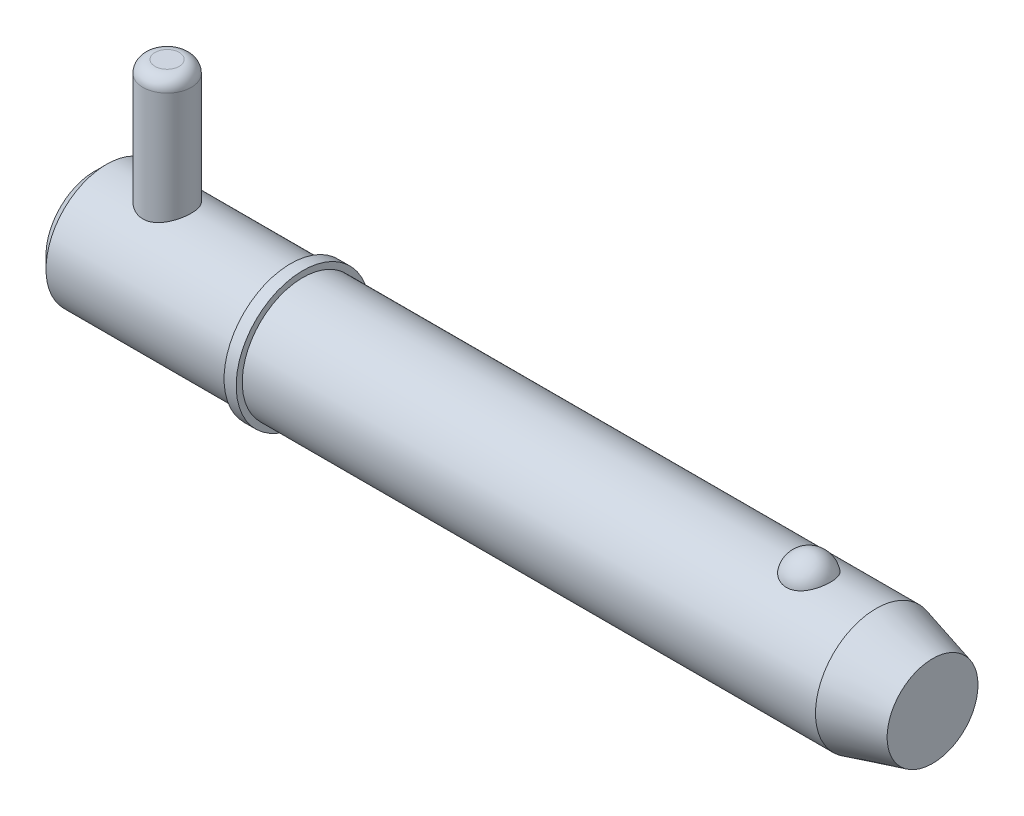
ISO-10303-21;
HEADER;
FILE_DESCRIPTION(('STEP AP214'),'2;1');
FILE_NAME('part.step','',(''),(''),'','','');
FILE_SCHEMA(('AUTOMOTIVE_DESIGN { 1 0 10303 214 1 1 1 1 }'));
ENDSEC;
DATA;
#1=APPLICATION_CONTEXT('core data for automotive mechanical design processes');
#2=APPLICATION_PROTOCOL_DEFINITION('international standard','automotive_design',2000,#1);
#3=PRODUCT_CONTEXT('',#1,'mechanical');
#4=PRODUCT('Part','Part','',(#3));
#5=PRODUCT_RELATED_PRODUCT_CATEGORY('part','',(#4));
#6=PRODUCT_DEFINITION_FORMATION('','',#4);
#7=PRODUCT_DEFINITION_CONTEXT('part definition',#1,'design');
#8=PRODUCT_DEFINITION('design','',#6,#7);
#9=PRODUCT_DEFINITION_SHAPE('','',#8);
#10=(LENGTH_UNIT() NAMED_UNIT(*) SI_UNIT(.MILLI.,.METRE.));
#11=(NAMED_UNIT(*) PLANE_ANGLE_UNIT() SI_UNIT($,.RADIAN.));
#12=(NAMED_UNIT(*) SI_UNIT($,.STERADIAN.) SOLID_ANGLE_UNIT());
#13=UNCERTAINTY_MEASURE_WITH_UNIT(LENGTH_MEASURE(1.E-05),#10,'distance_accuracy_value','');
#14=(GEOMETRIC_REPRESENTATION_CONTEXT(3) GLOBAL_UNCERTAINTY_ASSIGNED_CONTEXT((#13)) GLOBAL_UNIT_ASSIGNED_CONTEXT((#10,
#11,#12)) REPRESENTATION_CONTEXT('',''));
#15=CARTESIAN_POINT('',(0.,0.,0.));
#16=DIRECTION('',(0.,0.,1.));
#17=DIRECTION('',(1.,0.,0.));
#18=AXIS2_PLACEMENT_3D('',#15,#16,#17);
#19=CARTESIAN_POINT('',(9.525,23.81,0.));
#20=DIRECTION('',(0.,-1.,0.));
#21=DIRECTION('',(0.,0.,-1.));
#22=AXIS2_PLACEMENT_3D('',#19,#20,#21);
#23=CYLINDRICAL_SURFACE('',#22,3.175);
#24=CARTESIAN_POINT('',(9.525,-6.3525,0.));
#25=DIRECTION('',(0.,1.,0.));
#26=DIRECTION('',(0.,0.,1.));
#27=AXIS2_PLACEMENT_3D('',#24,#25,#26);
#28=CIRCLE('',#27,3.175);
#29=CARTESIAN_POINT('',(9.525,-6.3525,3.175));
#30=VERTEX_POINT('',#29);
#31=EDGE_CURVE('P0_E25',#30,#30,#28,.T.);
#32=ORIENTED_EDGE('',*,*,#31,.T.);
#33=EDGE_LOOP('',(#32));
#34=FACE_BOUND('',#33,.T.);
#35=CARTESIAN_POINT('',(9.525,22.2225,0.));
#36=DIRECTION('',(0.,1.,0.));
#37=DIRECTION('',(0.,0.,1.));
#38=AXIS2_PLACEMENT_3D('',#35,#36,#37);
#39=CIRCLE('',#38,3.175);
#40=CARTESIAN_POINT('',(9.525,22.2225,3.175));
#41=VERTEX_POINT('',#40);
#42=EDGE_CURVE('P0_E29',#41,#41,#39,.F.);
#43=ORIENTED_EDGE('',*,*,#42,.T.);
#44=EDGE_LOOP('',(#43));
#45=FACE_BOUND('',#44,.T.);
#46=ADVANCED_FACE('P0_F14',(#34,#45),#23,.T.);
#47=CARTESIAN_POINT('',(9.525,23.81,0.));
#48=DIRECTION('',(0.,1.,0.));
#49=DIRECTION('',(0.,0.,1.));
#50=AXIS2_PLACEMENT_3D('',#47,#48,#49);
#51=PLANE('',#50);
#52=CARTESIAN_POINT('',(9.525,23.81,0.));
#53=DIRECTION('',(0.,1.,0.));
#54=DIRECTION('',(0.,0.,1.));
#55=AXIS2_PLACEMENT_3D('',#52,#53,#54);
#56=CIRCLE('',#55,1.5875);
#57=CARTESIAN_POINT('',(9.525,23.81,1.5875));
#58=VERTEX_POINT('',#57);
#59=EDGE_CURVE('P0_E10',#58,#58,#56,.T.);
#60=ORIENTED_EDGE('',*,*,#59,.T.);
#61=EDGE_LOOP('',(#60));
#62=FACE_BOUND('',#61,.T.);
#63=ADVANCED_FACE('P0_F46',(#62),#51,.T.);
#64=CARTESIAN_POINT('',(9.525,-7.94,0.));
#65=DIRECTION('',(0.,1.,0.));
#66=DIRECTION('',(0.,0.,1.));
#67=AXIS2_PLACEMENT_3D('',#64,#65,#66);
#68=PLANE('',#67);
#69=CARTESIAN_POINT('',(9.525,-7.94,0.));
#70=DIRECTION('',(0.,1.,0.));
#71=DIRECTION('',(0.,0.,1.));
#72=AXIS2_PLACEMENT_3D('',#69,#70,#71);
#73=CIRCLE('',#72,1.5875);
#74=CARTESIAN_POINT('',(9.525,-7.94,1.5875));
#75=VERTEX_POINT('',#74);
#76=EDGE_CURVE('P0_E21',#75,#75,#73,.F.);
#77=ORIENTED_EDGE('',*,*,#76,.T.);
#78=EDGE_LOOP('',(#77));
#79=FACE_BOUND('',#78,.T.);
#80=ADVANCED_FACE('P0_F43',(#79),#68,.F.);
#81=CARTESIAN_POINT('',(9.525,-6.3525,0.));
#82=DIRECTION('',(0.,1.,0.));
#83=DIRECTION('',(0.,0.,1.));
#84=AXIS2_PLACEMENT_3D('',#81,#82,#83);
#85=DEGENERATE_TOROIDAL_SURFACE('',#84,1.5875,1.5875,.T.);
#86=ORIENTED_EDGE('',*,*,#76,.F.);
#87=EDGE_LOOP('',(#86));
#88=FACE_BOUND('',#87,.T.);
#89=ORIENTED_EDGE('',*,*,#31,.F.);
#90=EDGE_LOOP('',(#89));
#91=FACE_BOUND('',#90,.T.);
#92=ADVANCED_FACE('P0_F38',(#88,#91),#85,.T.);
#93=CARTESIAN_POINT('',(9.525,22.2225,0.));
#94=DIRECTION('',(0.,1.,0.));
#95=DIRECTION('',(0.,0.,1.));
#96=AXIS2_PLACEMENT_3D('',#93,#94,#95);
#97=DEGENERATE_TOROIDAL_SURFACE('',#96,1.5875,1.5875,.T.);
#98=ORIENTED_EDGE('',*,*,#42,.F.);
#99=EDGE_LOOP('',(#98));
#100=FACE_BOUND('',#99,.T.);
#101=ORIENTED_EDGE('',*,*,#59,.F.);
#102=EDGE_LOOP('',(#101));
#103=FACE_BOUND('',#102,.T.);
#104=ADVANCED_FACE('P0_F16',(#100,#103),#97,.T.);
#105=CLOSED_SHELL('',(#46,#63,#80,#92,#104));
#106=MANIFOLD_SOLID_BREP('P0_B1',#105);
#107=CARTESIAN_POINT('',(0.,0.,0.));
#108=DIRECTION('',(1.,0.,0.));
#109=DIRECTION('',(0.,0.,-1.));
#110=AXIS2_PLACEMENT_3D('',#107,#108,#109);
#111=CYLINDRICAL_SURFACE('',#110,7.94);
#112=CARTESIAN_POINT('',(102.451879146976,0.,0.));
#113=DIRECTION('',(1.,0.,0.));
#114=DIRECTION('',(0.,0.,-1.));
#115=AXIS2_PLACEMENT_3D('',#112,#113,#114);
#116=CIRCLE('',#115,7.94);
#117=CARTESIAN_POINT('',(102.451879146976,0.,-7.94));
#118=VERTEX_POINT('',#117);
#119=EDGE_CURVE('P1_E81',#118,#118,#116,.T.);
#120=ORIENTED_EDGE('',*,*,#119,.F.);
#121=EDGE_LOOP('',(#120));
#122=FACE_BOUND('',#121,.T.);
#123=CARTESIAN_POINT('',(27.31,0.,0.));
#124=DIRECTION('',(1.,0.,0.));
#125=DIRECTION('',(0.,0.,-1.));
#126=AXIS2_PLACEMENT_3D('',#123,#124,#125);
#127=CIRCLE('',#126,7.94);
#128=CARTESIAN_POINT('',(27.31,0.,-7.94));
#129=VERTEX_POINT('',#128);
#130=EDGE_CURVE('P1_E85',#129,#129,#127,.T.);
#131=ORIENTED_EDGE('',*,*,#130,.T.);
#132=EDGE_LOOP('',(#131));
#133=FACE_BOUND('',#132,.T.);
#134=CARTESIAN_POINT('',(93.6449074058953,7.37767842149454,2.93486986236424));
#135=CARTESIAN_POINT('',(93.4927496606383,7.37767329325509,2.9348750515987));
#136=CARTESIAN_POINT('',(93.3406329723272,7.38258419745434,2.92262454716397));
#137=CARTESIAN_POINT('',(93.0409284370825,7.40163229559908,2.87404196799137));
#138=CARTESIAN_POINT('',(92.8933394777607,7.41576720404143,2.83771585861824));
#139=CARTESIAN_POINT('',(92.6070187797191,7.45161576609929,2.74218769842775));
#140=CARTESIAN_POINT('',(92.4682745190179,7.47331841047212,2.68301886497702));
#141=CARTESIAN_POINT('',(92.2028822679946,7.52194082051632,2.54350967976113));
#142=CARTESIAN_POINT('',(92.0762366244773,7.54886159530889,2.46316523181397));
#143=CARTESIAN_POINT('',(91.8345349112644,7.60594671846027,2.28090375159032));
#144=CARTESIAN_POINT('',(91.7199065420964,7.63618114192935,2.1784421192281));
#145=CARTESIAN_POINT('',(91.5088787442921,7.69614046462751,1.95608495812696));
#146=CARTESIAN_POINT('',(91.4124826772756,7.72586526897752,1.83618622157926));
#147=CARTESIAN_POINT('',(91.2359381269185,7.78314821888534,1.57628086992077));
#148=CARTESIAN_POINT('',(91.1567072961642,7.81055035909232,1.43561546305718));
#149=CARTESIAN_POINT('',(91.0217979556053,7.85879631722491,1.14236334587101));
#150=CARTESIAN_POINT('',(90.9661216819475,7.87963951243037,0.98977550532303));
#151=CARTESIAN_POINT('',(90.8788121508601,7.91289645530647,0.674619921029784));
#152=CARTESIAN_POINT('',(90.8475309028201,7.92518652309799,0.511941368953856));
#153=CARTESIAN_POINT('',(90.8109756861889,7.93958930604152,0.18324773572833));
#154=CARTESIAN_POINT('',(90.8057012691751,7.94170219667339,0.0172327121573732));
#155=CARTESIAN_POINT('',(90.8212311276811,7.93554931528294,-0.312672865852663));
#156=CARTESIAN_POINT('',(90.8419253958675,7.92732732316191,-0.476569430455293));
#157=CARTESIAN_POINT('',(90.9087865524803,7.90141534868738,-0.798305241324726));
#158=CARTESIAN_POINT('',(90.9549539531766,7.88372517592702,-0.95614436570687));
#159=CARTESIAN_POINT('',(91.0718986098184,7.84066230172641,-1.26152073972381));
#160=CARTESIAN_POINT('',(91.1427046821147,7.81528060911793,-1.40904568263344));
#161=CARTESIAN_POINT('',(91.3074789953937,7.7594867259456,-1.68950598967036));
#162=CARTESIAN_POINT('',(91.4014488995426,7.72907417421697,-1.82244030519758));
#163=CARTESIAN_POINT('',(91.6108391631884,7.66640424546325,-2.07032792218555));
#164=CARTESIAN_POINT('',(91.7263152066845,7.63414223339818,-2.1852330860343));
#165=CARTESIAN_POINT('',(91.9759006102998,7.57149681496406,-2.39329737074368));
#166=CARTESIAN_POINT('',(92.1100080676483,7.54111321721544,-2.48645870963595));
#167=CARTESIAN_POINT('',(92.3901113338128,7.48650742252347,-2.64628132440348));
#168=CARTESIAN_POINT('',(92.5357605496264,7.46215900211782,-2.71350554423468));
#169=CARTESIAN_POINT('',(92.8374259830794,7.42171253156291,-2.82226614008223));
#170=CARTESIAN_POINT('',(92.9934383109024,7.40561140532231,-2.86381209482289));
#171=CARTESIAN_POINT('',(93.3029708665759,7.3842679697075,-2.91839077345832));
#172=CARTESIAN_POINT('',(93.4562229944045,7.37852109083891,-2.93275024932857));
#173=CARTESIAN_POINT('',(93.7630705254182,7.37700973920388,-2.93655208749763));
#174=CARTESIAN_POINT('',(93.9166658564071,7.38124333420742,-2.92599927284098));
#175=CARTESIAN_POINT('',(94.2149907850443,7.39890635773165,-2.88102897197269));
#176=CARTESIAN_POINT('',(94.3598480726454,7.41205491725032,-2.84733999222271));
#177=CARTESIAN_POINT('',(94.6416432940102,7.44580110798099,-2.75788206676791));
#178=CARTESIAN_POINT('',(94.7785805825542,7.46639934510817,-2.70211132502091));
#179=CARTESIAN_POINT('',(95.0440619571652,7.51339098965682,-2.56858908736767));
#180=CARTESIAN_POINT('',(95.1723548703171,7.5399020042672,-2.49038067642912));
#181=CARTESIAN_POINT('',(95.4142440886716,7.59569503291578,-2.31462737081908));
#182=CARTESIAN_POINT('',(95.5278370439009,7.6249776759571,-2.21707808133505));
#183=CARTESIAN_POINT('',(95.74322156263,7.68489473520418,-1.99982049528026));
#184=CARTESIAN_POINT('',(95.8441488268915,7.71552419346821,-1.87925337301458));
#185=CARTESIAN_POINT('',(96.0251866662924,7.77353016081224,-1.62268826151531));
#186=CARTESIAN_POINT('',(96.1052934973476,7.80090608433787,-1.48668750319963));
#187=CARTESIAN_POINT('',(96.2453615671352,7.85047992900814,-1.19818413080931));
#188=CARTESIAN_POINT('',(96.3045877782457,7.87248183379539,-1.04529016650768));
#189=CARTESIAN_POINT('',(96.3979821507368,7.90785114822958,-0.731080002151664));
#190=CARTESIAN_POINT('',(96.4321497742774,7.92121837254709,-0.569763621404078));
#191=CARTESIAN_POINT('',(96.474795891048,7.93797834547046,-0.24281228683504));
#192=CARTESIAN_POINT('',(96.4832047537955,7.94134405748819,-0.0771668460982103));
#193=CARTESIAN_POINT('',(96.4739626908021,7.93767937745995,0.253276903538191));
#194=CARTESIAN_POINT('',(96.4563120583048,7.93064910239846,0.418075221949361));
#195=CARTESIAN_POINT('',(96.395424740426,7.90695571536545,0.74152553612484));
#196=CARTESIAN_POINT('',(96.3522819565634,7.8903279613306,0.900197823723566));
#197=CARTESIAN_POINT('',(96.2413535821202,7.84916386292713,1.20759654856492));
#198=CARTESIAN_POINT('',(96.17356656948,7.82462706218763,1.35632241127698));
#199=CARTESIAN_POINT('',(96.0143718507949,7.7700669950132,1.64032869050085));
#200=CARTESIAN_POINT('',(95.9228616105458,7.74002008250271,1.7755471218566));
#201=CARTESIAN_POINT('',(95.7182960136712,7.67774175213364,2.02800648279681));
#202=CARTESIAN_POINT('',(95.6052410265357,7.64551037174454,2.14524772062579));
#203=CARTESIAN_POINT('',(95.3608318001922,7.58265895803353,2.35778002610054));
#204=CARTESIAN_POINT('',(95.2295833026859,7.55203092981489,2.45319004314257));
#205=CARTESIAN_POINT('',(94.951601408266,7.49579792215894,2.61999897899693));
#206=CARTESIAN_POINT('',(94.8048670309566,7.47019326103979,2.69139637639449));
#207=CARTESIAN_POINT('',(94.4929477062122,7.42622216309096,2.81053241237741));
#208=CARTESIAN_POINT('',(94.3272209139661,7.40825002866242,2.85700910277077));
#209=CARTESIAN_POINT('',(93.9892792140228,7.38398348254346,2.91916850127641));
#210=CARTESIAN_POINT('',(93.8170670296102,7.37768422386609,2.93486399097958));
#211=CARTESIAN_POINT('',(93.6449074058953,7.37767842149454,2.93486986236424));
#212=B_SPLINE_CURVE_WITH_KNOTS('',3,(#134,#135,#136,#137,#138,#139,#140,#141,#142,#143,#144,
#145,#146,#147,#148,#149,#150,#151,#152,#153,#154,#155,#156,#157,#158,#159,#160,#161,#162,#163,
#164,#165,#166,#167,#168,#169,#170,#171,#172,#173,#174,#175,#176,#177,#178,#179,#180,#181,#182,
#183,#184,#185,#186,#187,#188,#189,#190,#191,#192,#193,#194,#195,#196,#197,#198,#199,#200,#201,
#202,#203,#204,#205,#206,#207,#208,#209,#210,#211),.UNSPECIFIED.,.T.,.F.,(4,2,2,2,2,2,2,2,2,2,2,
2,2,2,2,2,2,2,2,2,2,2,2,2,2,2,2,2,2,2,2,2,2,2,2,2,2,2,4),(0.,0.455841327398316,
0.911569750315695,1.36663794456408,1.82179423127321,2.28978983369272,2.75787163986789,
3.24685368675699,3.73588214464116,4.23184282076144,4.72779494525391,5.22165321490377,
5.71552141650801,6.20996917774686,6.70445245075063,7.200234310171,7.69596557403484,
8.18023418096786,8.66432203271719,9.12410697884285,9.58380291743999,10.0296503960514,
10.475534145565,10.9312349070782,11.3870393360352,11.8654416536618,12.3439299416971,
12.8378875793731,13.3318558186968,13.8271581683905,14.3224549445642,14.8159385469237,
15.3094506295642,15.8051323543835,16.3008055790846,16.7937101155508,17.2866458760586,
17.8026240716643,18.3183879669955),.UNSPECIFIED.);
#213=CARTESIAN_POINT('',(93.6449074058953,7.37767842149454,2.93486986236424));
#214=VERTEX_POINT('',#213);
#215=EDGE_CURVE('P1_E35',#214,#214,#212,.T.);
#216=ORIENTED_EDGE('',*,*,#215,.T.);
#217=EDGE_LOOP('',(#216));
#218=FACE_BOUND('',#217,.T.);
#219=ADVANCED_FACE('P1_F13',(#122,#133,#218),#111,.T.);
#220=CARTESIAN_POINT('',(0.,0.,0.));
#221=DIRECTION('',(-1.,0.,0.));
#222=DIRECTION('',(0.,0.,1.));
#223=AXIS2_PLACEMENT_3D('',#220,#221,#222);
#224=PLANE('',#223);
#225=CARTESIAN_POINT('',(0.,0.,0.));
#226=DIRECTION('',(1.,0.,0.));
#227=DIRECTION('',(0.,0.,-1.));
#228=AXIS2_PLACEMENT_3D('',#225,#226,#227);
#229=CIRCLE('',#228,6.352);
#230=CARTESIAN_POINT('',(0.,0.,-6.352));
#231=VERTEX_POINT('',#230);
#232=EDGE_CURVE('P1_E9',#231,#231,#229,.T.);
#233=ORIENTED_EDGE('',*,*,#232,.F.);
#234=EDGE_LOOP('',(#233));
#235=FACE_BOUND('',#234,.T.);
#236=ADVANCED_FACE('P1_F15',(#235),#224,.T.);
#237=CARTESIAN_POINT('',(1.58799999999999,0.,0.));
#238=DIRECTION('',(1.,0.,0.));
#239=DIRECTION('',(0.,0.,-1.));
#240=AXIS2_PLACEMENT_3D('',#237,#238,#239);
#241=CONICAL_SURFACE('',#240,7.94,0.78539816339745);
#242=ORIENTED_EDGE('',*,*,#232,.T.);
#243=EDGE_LOOP('',(#242));
#244=FACE_BOUND('',#243,.T.);
#245=CARTESIAN_POINT('',(1.58799999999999,0.,0.));
#246=DIRECTION('',(1.,0.,0.));
#247=DIRECTION('',(0.,0.,-1.));
#248=AXIS2_PLACEMENT_3D('',#245,#246,#247);
#249=CIRCLE('',#248,7.94);
#250=CARTESIAN_POINT('',(1.58799999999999,0.,-7.94));
#251=VERTEX_POINT('',#250);
#252=EDGE_CURVE('P1_E26',#251,#251,#249,.T.);
#253=ORIENTED_EDGE('',*,*,#252,.F.);
#254=EDGE_LOOP('',(#253));
#255=FACE_BOUND('',#254,.T.);
#256=ADVANCED_FACE('P1_F77',(#244,#255),#241,.T.);
#257=CARTESIAN_POINT('',(0.,0.,0.));
#258=DIRECTION('',(1.,0.,0.));
#259=DIRECTION('',(0.,0.,-1.));
#260=AXIS2_PLACEMENT_3D('',#257,#258,#259);
#261=CYLINDRICAL_SURFACE('',#260,7.94);
#262=CARTESIAN_POINT('',(9.525,-7.27756655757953,3.175));
#263=CARTESIAN_POINT('',(9.43992346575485,-7.27756715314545,3.17499935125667));
#264=CARTESIAN_POINT('',(9.35481882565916,-7.27906496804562,3.1715736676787));
#265=CARTESIAN_POINT('',(9.18524505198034,-7.28499816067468,3.15791803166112));
#266=CARTESIAN_POINT('',(9.100776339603,-7.28943533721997,3.14768391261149));
#267=CARTESIAN_POINT('',(8.84895715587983,-7.30698881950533,3.10684226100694));
#268=CARTESIAN_POINT('',(8.6834173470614,-7.32434654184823,3.06609574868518));
#269=CARTESIAN_POINT('',(8.36278910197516,-7.36806950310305,2.95945910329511));
#270=CARTESIAN_POINT('',(8.20766386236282,-7.39440078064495,2.89366366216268));
#271=CARTESIAN_POINT('',(7.91065319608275,-7.45304562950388,2.73907413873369));
#272=CARTESIAN_POINT('',(7.76876488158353,-7.48535789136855,2.65028508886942));
#273=CARTESIAN_POINT('',(7.49411086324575,-7.55439482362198,2.44679888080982));
#274=CARTESIAN_POINT('',(7.36219910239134,-7.59126138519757,2.33099745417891));
#275=CARTESIAN_POINT('',(7.11904234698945,-7.66408045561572,2.07909838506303));
#276=CARTESIAN_POINT('',(7.00780457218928,-7.70003264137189,1.94299368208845));
#277=CARTESIAN_POINT('',(6.80492173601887,-7.76867514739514,1.64775981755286));
#278=CARTESIAN_POINT('',(6.71422139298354,-7.80118112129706,1.48793473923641));
#279=CARTESIAN_POINT('',(6.56135788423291,-7.85754918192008,1.15376269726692));
#280=CARTESIAN_POINT('',(6.49918311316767,-7.88141478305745,0.979421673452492));
#281=CARTESIAN_POINT('',(6.40818142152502,-7.91680873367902,0.630115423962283));
#282=CARTESIAN_POINT('',(6.3778864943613,-7.9288781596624,0.455588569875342));
#283=CARTESIAN_POINT('',(6.34677743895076,-7.94127547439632,0.103539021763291));
#284=CARTESIAN_POINT('',(6.34595232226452,-7.94160773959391,-0.0739825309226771));
#285=CARTESIAN_POINT('',(6.37300128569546,-7.93082261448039,-0.416371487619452));
#286=CARTESIAN_POINT('',(6.39926693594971,-7.92034690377,-0.581389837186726));
#287=CARTESIAN_POINT('',(6.47701615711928,-7.88998770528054,-0.904449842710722));
#288=CARTESIAN_POINT('',(6.52850157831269,-7.87010352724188,-1.06249098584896));
#289=CARTESIAN_POINT('',(6.65586120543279,-7.82249343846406,-1.36995769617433));
#290=CARTESIAN_POINT('',(6.73209124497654,-7.79465387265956,-1.51921754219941));
#291=CARTESIAN_POINT('',(6.90644286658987,-7.73389606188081,-1.80321183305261));
#292=CARTESIAN_POINT('',(7.00457194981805,-7.70097607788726,-1.93794127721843));
#293=CARTESIAN_POINT('',(7.22744086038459,-7.63084889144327,-2.19843606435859));
#294=CARTESIAN_POINT('',(7.35350432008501,-7.59350211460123,-2.3230330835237));
#295=CARTESIAN_POINT('',(7.62488266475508,-7.52039654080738,-2.54979642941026));
#296=CARTESIAN_POINT('',(7.77020381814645,-7.48463826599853,-2.65195542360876));
#297=CARTESIAN_POINT('',(8.08119298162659,-7.41780943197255,-2.83361305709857));
#298=CARTESIAN_POINT('',(8.24731937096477,-7.38689959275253,-2.91239105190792));
#299=CARTESIAN_POINT('',(8.59204539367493,-7.33515216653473,-3.04038913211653));
#300=CARTESIAN_POINT('',(8.77063684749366,-7.31430804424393,-3.08962840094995));
#301=CARTESIAN_POINT('',(9.12356982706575,-7.28663831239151,-3.15431018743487));
#302=CARTESIAN_POINT('',(9.29750494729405,-7.2790344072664,-3.17163284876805));
#303=CARTESIAN_POINT('',(9.64592502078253,-7.27648884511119,-3.17747282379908));
#304=CARTESIAN_POINT('',(9.82040979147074,-7.28154335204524,-3.16599886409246));
#305=CARTESIAN_POINT('',(10.1545374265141,-7.30294638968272,-3.11628310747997));
#306=CARTESIAN_POINT('',(10.3144598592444,-7.31863587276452,-3.0796016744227));
#307=CARTESIAN_POINT('',(10.625774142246,-7.35872371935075,-2.98253618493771));
#308=CARTESIAN_POINT('',(10.7771640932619,-7.38312401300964,-2.92214687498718));
#309=CARTESIAN_POINT('',(11.0739599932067,-7.4390944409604,-2.77664664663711));
#310=CARTESIAN_POINT('',(11.2188745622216,-7.47091513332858,-2.69063278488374));
#311=CARTESIAN_POINT('',(11.4928722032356,-7.53775867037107,-2.49724834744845));
#312=CARTESIAN_POINT('',(11.6219487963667,-7.57278281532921,-2.38986907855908));
#313=CARTESIAN_POINT('',(11.8705091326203,-7.64520845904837,-2.1474449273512));
#314=CARTESIAN_POINT('',(11.9885816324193,-7.68259462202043,-2.01094304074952));
#315=CARTESIAN_POINT('',(12.2003631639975,-7.75309951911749,-1.71917041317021));
#316=CARTESIAN_POINT('',(12.2940712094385,-7.78621808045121,-1.56389891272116));
#317=CARTESIAN_POINT('',(12.4541161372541,-7.84456050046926,-1.23845027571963));
#318=CARTESIAN_POINT('',(12.5204600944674,-7.86978639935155,-1.06827700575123));
#319=CARTESIAN_POINT('',(12.6231407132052,-7.90943635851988,-0.717928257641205));
#320=CARTESIAN_POINT('',(12.6594936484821,-7.92386627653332,-0.537758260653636));
#321=CARTESIAN_POINT('',(12.6992281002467,-7.93967263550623,-0.185201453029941));
#322=CARTESIAN_POINT('',(12.7046050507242,-7.94183891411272,-0.0130732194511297));
#323=CARTESIAN_POINT('',(12.6875036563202,-7.9350072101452,0.329549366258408));
#324=CARTESIAN_POINT('',(12.6650295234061,-7.92601091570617,0.500043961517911));
#325=CARTESIAN_POINT('',(12.5942896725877,-7.89825976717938,0.829196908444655));
#326=CARTESIAN_POINT('',(12.5468364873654,-7.87981280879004,0.988057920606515));
#327=CARTESIAN_POINT('',(12.4283390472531,-7.83513565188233,1.29553461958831));
#328=CARTESIAN_POINT('',(12.3572904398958,-7.8089040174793,1.44414841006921));
#329=CARTESIAN_POINT('',(12.1900822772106,-7.7497911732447,1.73412879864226));
#330=CARTESIAN_POINT('',(12.0929519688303,-7.71666737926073,1.87488510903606));
#331=CARTESIAN_POINT('',(11.8777894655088,-7.64775894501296,2.13869231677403));
#332=CARTESIAN_POINT('',(11.7597486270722,-7.61197320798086,2.26173585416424));
#333=CARTESIAN_POINT('',(11.4974896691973,-7.53902341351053,2.49449755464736));
#334=CARTESIAN_POINT('',(11.3521039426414,-7.50191102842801,2.60292060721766));
#335=CARTESIAN_POINT('',(11.0440201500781,-7.43289551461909,2.79392602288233));
#336=CARTESIAN_POINT('',(10.8813200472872,-7.40099299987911,2.87650534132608));
#337=CARTESIAN_POINT('',(10.558064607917,-7.3489506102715,3.00682739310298));
#338=CARTESIAN_POINT('',(10.398627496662,-7.32801197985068,3.05703164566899));
#339=CARTESIAN_POINT('',(10.0731242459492,-7.29639491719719,3.13175843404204));
#340=CARTESIAN_POINT('',(9.90707793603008,-7.28568789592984,3.15635254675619));
#341=CARTESIAN_POINT('',(9.70441566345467,-7.27968826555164,3.17013149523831));
#342=CARTESIAN_POINT('',(9.66856669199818,-7.27889378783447,3.17195593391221));
#343=CARTESIAN_POINT('',(9.59681348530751,-7.27783278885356,3.17439036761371));
#344=CARTESIAN_POINT('',(9.56090924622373,-7.27756630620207,3.17500027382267));
#345=CARTESIAN_POINT('',(9.525,-7.27756655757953,3.175));
#346=B_SPLINE_CURVE_WITH_KNOTS('',3,(#262,#263,#264,#265,#266,#267,#268,#269,#270,#271,#272,
#273,#274,#275,#276,#277,#278,#279,#280,#281,#282,#283,#284,#285,#286,#287,#288,#289,#290,#291,
#292,#293,#294,#295,#296,#297,#298,#299,#300,#301,#302,#303,#304,#305,#306,#307,#308,#309,#310,
#311,#312,#313,#314,#315,#316,#317,#318,#319,#320,#321,#322,#323,#324,#325,#326,#327,#328,#329,
#330,#331,#332,#333,#334,#335,#336,#337,#338,#339,#340,#341,#342,#343,#344,#345),.UNSPECIFIED.,
.T.,.F.,(4,2,2,2,2,2,2,2,2,2,2,2,2,2,2,2,2,2,2,2,2,2,2,2,2,2,2,2,2,2,2,2,2,2,2,2,2,2,2,2,2,4),
(0.,0.255187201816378,0.510530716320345,1.0218798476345,1.53131482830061,2.04063840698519,
2.57635929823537,3.11226692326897,3.66929090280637,4.22608806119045,4.75594400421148,
5.28560237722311,5.78552836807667,6.28549104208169,6.79298787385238,7.30065880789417,
7.8416422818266,8.38280228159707,8.93923025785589,9.49529647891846,10.0174074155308,
10.5393601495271,11.0316114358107,11.5239718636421,12.0362920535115,12.5488211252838,
13.0991799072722,13.6495609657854,14.1997996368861,14.7497395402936,15.2638187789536,
15.7778202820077,16.2760504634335,16.7743726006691,17.294711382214,17.8152657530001,
18.3680208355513,18.9208410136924,19.4240423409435,19.9258334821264,20.0335354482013,
20.1412452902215),.UNSPECIFIED.);
#347=CARTESIAN_POINT('',(9.525,-7.27756655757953,3.175));
#348=VERTEX_POINT('',#347);
#349=EDGE_CURVE('P1_E17',#348,#348,#346,.T.);
#350=ORIENTED_EDGE('',*,*,#349,.F.);
#351=EDGE_LOOP('',(#350));
#352=FACE_BOUND('',#351,.T.);
#353=CARTESIAN_POINT('',(9.525,7.27756655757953,3.175));
#354=CARTESIAN_POINT('',(9.61007653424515,7.27756715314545,3.17499935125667));
#355=CARTESIAN_POINT('',(9.69518117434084,7.27906496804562,3.1715736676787));
#356=CARTESIAN_POINT('',(9.86475494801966,7.28499816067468,3.15791803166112));
#357=CARTESIAN_POINT('',(9.949223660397,7.28943533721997,3.14768391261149));
#358=CARTESIAN_POINT('',(10.2010428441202,7.30698881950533,3.10684226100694));
#359=CARTESIAN_POINT('',(10.3665826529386,7.32434654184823,3.06609574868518));
#360=CARTESIAN_POINT('',(10.6872108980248,7.36806950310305,2.95945910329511));
#361=CARTESIAN_POINT('',(10.8423361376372,7.39440078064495,2.89366366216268));
#362=CARTESIAN_POINT('',(11.1393468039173,7.45304562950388,2.73907413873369));
#363=CARTESIAN_POINT('',(11.2812351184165,7.48535789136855,2.65028508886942));
#364=CARTESIAN_POINT('',(11.5558891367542,7.55439482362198,2.44679888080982));
#365=CARTESIAN_POINT('',(11.6878008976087,7.59126138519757,2.33099745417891));
#366=CARTESIAN_POINT('',(11.9309576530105,7.66408045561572,2.07909838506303));
#367=CARTESIAN_POINT('',(12.0421954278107,7.70003264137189,1.94299368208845));
#368=CARTESIAN_POINT('',(12.2450782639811,7.76867514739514,1.64775981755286));
#369=CARTESIAN_POINT('',(12.3357786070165,7.80118112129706,1.48793473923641));
#370=CARTESIAN_POINT('',(12.4886421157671,7.85754918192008,1.15376269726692));
#371=CARTESIAN_POINT('',(12.5508168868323,7.88141478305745,0.979421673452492));
#372=CARTESIAN_POINT('',(12.641818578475,7.91680873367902,0.630115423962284));
#373=CARTESIAN_POINT('',(12.6721135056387,7.9288781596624,0.455588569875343));
#374=CARTESIAN_POINT('',(12.7032225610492,7.94127547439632,0.103539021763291));
#375=CARTESIAN_POINT('',(12.7040476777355,7.94160773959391,-0.0739825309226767));
#376=CARTESIAN_POINT('',(12.6769987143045,7.93082261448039,-0.416371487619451));
#377=CARTESIAN_POINT('',(12.6507330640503,7.92034690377,-0.581389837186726));
#378=CARTESIAN_POINT('',(12.5729838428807,7.88998770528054,-0.904449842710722));
#379=CARTESIAN_POINT('',(12.5214984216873,7.87010352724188,-1.06249098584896));
#380=CARTESIAN_POINT('',(12.3941387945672,7.82249343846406,-1.36995769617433));
#381=CARTESIAN_POINT('',(12.3179087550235,7.79465387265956,-1.51921754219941));
#382=CARTESIAN_POINT('',(12.1435571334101,7.73389606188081,-1.80321183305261));
#383=CARTESIAN_POINT('',(12.0454280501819,7.70097607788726,-1.93794127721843));
#384=CARTESIAN_POINT('',(11.8225591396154,7.63084889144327,-2.19843606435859));
#385=CARTESIAN_POINT('',(11.696495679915,7.59350211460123,-2.3230330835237));
#386=CARTESIAN_POINT('',(11.4251173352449,7.52039654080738,-2.54979642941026));
#387=CARTESIAN_POINT('',(11.2797961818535,7.48463826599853,-2.65195542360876));
#388=CARTESIAN_POINT('',(10.9688070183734,7.41780943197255,-2.83361305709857));
#389=CARTESIAN_POINT('',(10.8026806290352,7.38689959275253,-2.91239105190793));
#390=CARTESIAN_POINT('',(10.4579546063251,7.33515216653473,-3.04038913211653));
#391=CARTESIAN_POINT('',(10.2793631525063,7.31430804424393,-3.08962840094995));
#392=CARTESIAN_POINT('',(9.92643017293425,7.28663831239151,-3.15431018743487));
#393=CARTESIAN_POINT('',(9.75249505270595,7.2790344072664,-3.17163284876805));
#394=CARTESIAN_POINT('',(9.40407497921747,7.2764888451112,-3.17747282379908));
#395=CARTESIAN_POINT('',(9.22959020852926,7.28154335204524,-3.16599886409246));
#396=CARTESIAN_POINT('',(8.89546257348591,7.30294638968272,-3.11628310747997));
#397=CARTESIAN_POINT('',(8.73554014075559,7.31863587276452,-3.0796016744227));
#398=CARTESIAN_POINT('',(8.42422585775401,7.35872371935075,-2.98253618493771));
#399=CARTESIAN_POINT('',(8.27283590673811,7.38312401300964,-2.92214687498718));
#400=CARTESIAN_POINT('',(7.97604000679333,7.4390944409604,-2.77664664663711));
#401=CARTESIAN_POINT('',(7.83112543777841,7.47091513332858,-2.69063278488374));
#402=CARTESIAN_POINT('',(7.55712779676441,7.53775867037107,-2.49724834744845));
#403=CARTESIAN_POINT('',(7.42805120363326,7.57278281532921,-2.38986907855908));
#404=CARTESIAN_POINT('',(7.17949086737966,7.64520845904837,-2.1474449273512));
#405=CARTESIAN_POINT('',(7.06141836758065,7.68259462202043,-2.01094304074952));
#406=CARTESIAN_POINT('',(6.8496368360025,7.75309951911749,-1.71917041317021));
#407=CARTESIAN_POINT('',(6.75592879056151,7.78621808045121,-1.56389891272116));
#408=CARTESIAN_POINT('',(6.59588386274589,7.84456050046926,-1.23845027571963));
#409=CARTESIAN_POINT('',(6.52953990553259,7.86978639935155,-1.06827700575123));
#410=CARTESIAN_POINT('',(6.42685928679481,7.90943635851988,-0.717928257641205));
#411=CARTESIAN_POINT('',(6.39050635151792,7.92386627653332,-0.537758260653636));
#412=CARTESIAN_POINT('',(6.35077189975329,7.93967263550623,-0.18520145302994));
#413=CARTESIAN_POINT('',(6.34539494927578,7.94183891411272,-0.0130732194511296));
#414=CARTESIAN_POINT('',(6.36249634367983,7.9350072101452,0.329549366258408));
#415=CARTESIAN_POINT('',(6.38497047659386,7.92601091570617,0.500043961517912));
#416=CARTESIAN_POINT('',(6.45571032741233,7.89825976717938,0.829196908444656));
#417=CARTESIAN_POINT('',(6.50316351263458,7.87981280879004,0.988057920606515));
#418=CARTESIAN_POINT('',(6.62166095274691,7.83513565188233,1.29553461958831));
#419=CARTESIAN_POINT('',(6.69270956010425,7.8089040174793,1.44414841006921));
#420=CARTESIAN_POINT('',(6.85991772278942,7.7497911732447,1.73412879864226));
#421=CARTESIAN_POINT('',(6.95704803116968,7.71666737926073,1.87488510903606));
#422=CARTESIAN_POINT('',(7.17221053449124,7.64775894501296,2.13869231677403));
#423=CARTESIAN_POINT('',(7.29025137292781,7.61197320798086,2.26173585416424));
#424=CARTESIAN_POINT('',(7.55251033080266,7.53902341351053,2.49449755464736));
#425=CARTESIAN_POINT('',(7.69789605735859,7.50191102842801,2.60292060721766));
#426=CARTESIAN_POINT('',(8.00597984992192,7.43289551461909,2.79392602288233));
#427=CARTESIAN_POINT('',(8.16867995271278,7.40099299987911,2.87650534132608));
#428=CARTESIAN_POINT('',(8.49193539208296,7.3489506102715,3.00682739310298));
#429=CARTESIAN_POINT('',(8.65137250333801,7.32801197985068,3.05703164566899));
#430=CARTESIAN_POINT('',(8.97687575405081,7.29639491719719,3.13175843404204));
#431=CARTESIAN_POINT('',(9.14292206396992,7.28568789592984,3.15635254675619));
#432=CARTESIAN_POINT('',(9.34558433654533,7.27968826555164,3.17013149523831));
#433=CARTESIAN_POINT('',(9.38143330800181,7.27889378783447,3.17195593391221));
#434=CARTESIAN_POINT('',(9.45318651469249,7.27783278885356,3.17439036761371));
#435=CARTESIAN_POINT('',(9.48909075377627,7.27756630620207,3.17500027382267));
#436=CARTESIAN_POINT('',(9.525,7.27756655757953,3.175));
#437=B_SPLINE_CURVE_WITH_KNOTS('',3,(#353,#354,#355,#356,#357,#358,#359,#360,#361,#362,#363,
#364,#365,#366,#367,#368,#369,#370,#371,#372,#373,#374,#375,#376,#377,#378,#379,#380,#381,#382,
#383,#384,#385,#386,#387,#388,#389,#390,#391,#392,#393,#394,#395,#396,#397,#398,#399,#400,#401,
#402,#403,#404,#405,#406,#407,#408,#409,#410,#411,#412,#413,#414,#415,#416,#417,#418,#419,#420,
#421,#422,#423,#424,#425,#426,#427,#428,#429,#430,#431,#432,#433,#434,#435,#436),.UNSPECIFIED.,
.T.,.F.,(4,2,2,2,2,2,2,2,2,2,2,2,2,2,2,2,2,2,2,2,2,2,2,2,2,2,2,2,2,2,2,2,2,2,2,2,2,2,2,2,2,4),
(0.,0.255187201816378,0.510530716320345,1.0218798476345,1.53131482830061,2.04063840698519,
2.57635929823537,3.11226692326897,3.66929090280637,4.22608806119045,4.75594400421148,
5.2856023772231,5.78552836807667,6.28549104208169,6.79298787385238,7.30065880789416,
7.8416422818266,8.38280228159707,8.9392302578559,9.49529647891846,10.0174074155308,
10.5393601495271,11.0316114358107,11.5239718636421,12.0362920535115,12.5488211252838,
13.0991799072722,13.6495609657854,14.1997996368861,14.7497395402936,15.2638187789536,
15.7778202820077,16.2760504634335,16.7743726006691,17.294711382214,17.8152657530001,
18.3680208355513,18.9208410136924,19.4240423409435,19.9258334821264,20.0335354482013,
20.1412452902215),.UNSPECIFIED.);
#438=CARTESIAN_POINT('',(9.525,7.27756655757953,3.175));
#439=VERTEX_POINT('',#438);
#440=EDGE_CURVE('P1_E43',#439,#439,#437,.T.);
#441=ORIENTED_EDGE('',*,*,#440,.F.);
#442=EDGE_LOOP('',(#441));
#443=FACE_BOUND('',#442,.T.);
#444=ORIENTED_EDGE('',*,*,#252,.T.);
#445=EDGE_LOOP('',(#444));
#446=FACE_BOUND('',#445,.T.);
#447=CARTESIAN_POINT('',(25.722,0.,0.));
#448=DIRECTION('',(1.,0.,0.));
#449=DIRECTION('',(0.,0.,-1.));
#450=AXIS2_PLACEMENT_3D('',#447,#448,#449);
#451=CIRCLE('',#450,7.94);
#452=CARTESIAN_POINT('',(25.722,0.,-7.94));
#453=VERTEX_POINT('',#452);
#454=EDGE_CURVE('P1_E31',#453,#453,#451,.T.);
#455=ORIENTED_EDGE('',*,*,#454,.F.);
#456=EDGE_LOOP('',(#455));
#457=FACE_BOUND('',#456,.T.);
#458=ADVANCED_FACE('P1_F103',(#352,#443,#446,#457),#261,.T.);
#459=CARTESIAN_POINT('',(25.722,7.94,0.));
#460=DIRECTION('',(-1.,0.,0.));
#461=DIRECTION('',(0.,0.,1.));
#462=AXIS2_PLACEMENT_3D('',#459,#460,#461);
#463=PLANE('',#462);
#464=ORIENTED_EDGE('',*,*,#454,.T.);
#465=EDGE_LOOP('',(#464));
#466=FACE_BOUND('',#465,.T.);
#467=CARTESIAN_POINT('',(25.722,0.,0.));
#468=DIRECTION('',(1.,0.,0.));
#469=DIRECTION('',(0.,0.,-1.));
#470=AXIS2_PLACEMENT_3D('',#467,#468,#469);
#471=CIRCLE('',#470,8.734);
#472=CARTESIAN_POINT('',(25.722,0.,-8.734));
#473=VERTEX_POINT('',#472);
#474=EDGE_CURVE('P1_E91',#473,#473,#471,.T.);
#475=ORIENTED_EDGE('',*,*,#474,.F.);
#476=EDGE_LOOP('',(#475));
#477=FACE_BOUND('',#476,.T.);
#478=ADVANCED_FACE('P1_F100',(#466,#477),#463,.T.);
#479=CARTESIAN_POINT('',(0.,0.,0.));
#480=DIRECTION('',(1.,0.,0.));
#481=DIRECTION('',(0.,0.,-1.));
#482=AXIS2_PLACEMENT_3D('',#479,#480,#481);
#483=CYLINDRICAL_SURFACE('',#482,8.734);
#484=ORIENTED_EDGE('',*,*,#474,.T.);
#485=EDGE_LOOP('',(#484));
#486=FACE_BOUND('',#485,.T.);
#487=CARTESIAN_POINT('',(27.31,0.,0.));
#488=DIRECTION('',(1.,0.,0.));
#489=DIRECTION('',(0.,0.,-1.));
#490=AXIS2_PLACEMENT_3D('',#487,#488,#489);
#491=CIRCLE('',#490,8.734);
#492=CARTESIAN_POINT('',(27.31,0.,-8.734));
#493=VERTEX_POINT('',#492);
#494=EDGE_CURVE('P1_E88',#493,#493,#491,.T.);
#495=ORIENTED_EDGE('',*,*,#494,.F.);
#496=EDGE_LOOP('',(#495));
#497=FACE_BOUND('',#496,.T.);
#498=ADVANCED_FACE('P1_F68',(#486,#497),#483,.T.);
#499=CARTESIAN_POINT('',(27.31,8.734,0.));
#500=DIRECTION('',(1.,0.,0.));
#501=DIRECTION('',(0.,0.,-1.));
#502=AXIS2_PLACEMENT_3D('',#499,#500,#501);
#503=PLANE('',#502);
#504=ORIENTED_EDGE('',*,*,#494,.T.);
#505=EDGE_LOOP('',(#504));
#506=FACE_BOUND('',#505,.T.);
#507=ORIENTED_EDGE('',*,*,#130,.F.);
#508=EDGE_LOOP('',(#507));
#509=FACE_BOUND('',#508,.T.);
#510=ADVANCED_FACE('P1_F62',(#506,#509),#503,.T.);
#511=CARTESIAN_POINT('',(109.86,0.,0.));
#512=DIRECTION('',(-1.,0.,0.));
#513=DIRECTION('',(0.,0.,1.));
#514=AXIS2_PLACEMENT_3D('',#511,#512,#513);
#515=CONICAL_SURFACE('',#514,5.95500000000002,0.26179938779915);
#516=ORIENTED_EDGE('',*,*,#119,.T.);
#517=EDGE_LOOP('',(#516));
#518=FACE_BOUND('',#517,.T.);
#519=CARTESIAN_POINT('',(109.86,0.,0.));
#520=DIRECTION('',(1.,0.,0.));
#521=DIRECTION('',(0.,0.,-1.));
#522=AXIS2_PLACEMENT_3D('',#519,#520,#521);
#523=CIRCLE('',#522,5.95500000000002);
#524=CARTESIAN_POINT('',(109.86,0.,-5.95500000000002));
#525=VERTEX_POINT('',#524);
#526=EDGE_CURVE('P1_E42',#525,#525,#523,.T.);
#527=ORIENTED_EDGE('',*,*,#526,.F.);
#528=EDGE_LOOP('',(#527));
#529=FACE_BOUND('',#528,.T.);
#530=ADVANCED_FACE('P1_F59',(#518,#529),#515,.T.);
#531=CARTESIAN_POINT('',(109.86,5.95500000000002,0.));
#532=DIRECTION('',(1.,0.,0.));
#533=DIRECTION('',(0.,0.,-1.));
#534=AXIS2_PLACEMENT_3D('',#531,#532,#533);
#535=PLANE('',#534);
#536=ORIENTED_EDGE('',*,*,#526,.T.);
#537=EDGE_LOOP('',(#536));
#538=FACE_BOUND('',#537,.T.);
#539=ADVANCED_FACE('P1_F55',(#538),#535,.T.);
#540=CARTESIAN_POINT('',(93.6449074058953,7.146,0.));
#541=DIRECTION('',(-1.,0.,0.));
#542=DIRECTION('',(0.,1.,0.));
#543=AXIS2_PLACEMENT_3D('',#540,#541,#542);
#544=SPHERICAL_SURFACE('',#543,2.94400000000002);
#545=ORIENTED_EDGE('',*,*,#215,.F.);
#546=EDGE_LOOP('',(#545));
#547=FACE_BOUND('',#546,.T.);
#548=ADVANCED_FACE('P1_F50',(#547),#544,.T.);
#549=CARTESIAN_POINT('',(9.525,-8.734,0.));
#550=DIRECTION('',(0.,1.,0.));
#551=DIRECTION('',(0.,0.,1.));
#552=AXIS2_PLACEMENT_3D('',#549,#550,#551);
#553=CYLINDRICAL_SURFACE('',#552,3.175);
#554=ORIENTED_EDGE('',*,*,#349,.T.);
#555=EDGE_LOOP('',(#554));
#556=FACE_BOUND('',#555,.T.);
#557=ORIENTED_EDGE('',*,*,#440,.T.);
#558=EDGE_LOOP('',(#557));
#559=FACE_BOUND('',#558,.T.);
#560=ADVANCED_FACE('P1_F54',(#556,#559),#553,.F.);
#561=CLOSED_SHELL('',(#219,#236,#256,#458,#478,#498,#510,#530,#539,#548,#560));
#562=MANIFOLD_SOLID_BREP('P1_B1',#561);
#563=ADVANCED_BREP_SHAPE_REPRESENTATION('',(#18,#106,#562),#14);
#564=SHAPE_DEFINITION_REPRESENTATION(#9,#563);
ENDSEC;
END-ISO-10303-21;
